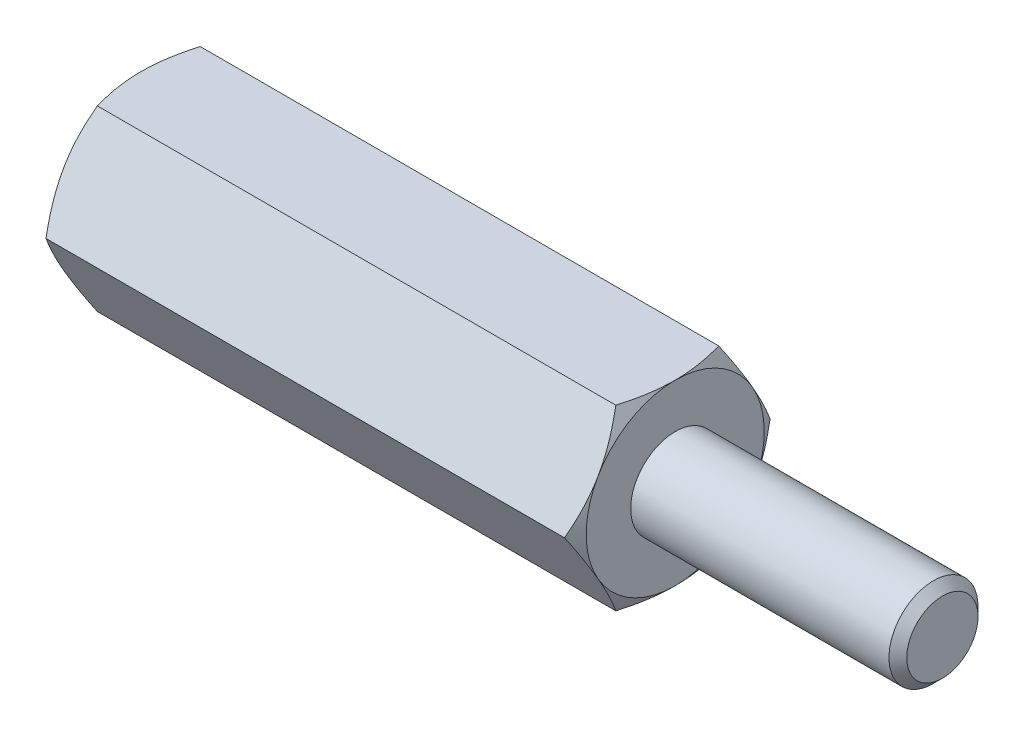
ISO-10303-21;
HEADER;
FILE_DESCRIPTION(('STEP AP214'),'2;1');
FILE_NAME('part.step','',(''),(''),'','','');
FILE_SCHEMA(('AUTOMOTIVE_DESIGN { 1 0 10303 214 1 1 1 1 }'));
ENDSEC;
DATA;
#1=APPLICATION_CONTEXT('core data for automotive mechanical design processes');
#2=APPLICATION_PROTOCOL_DEFINITION('international standard','automotive_design',2000,#1);
#3=PRODUCT_CONTEXT('',#1,'mechanical');
#4=PRODUCT('Part','Part','',(#3));
#5=PRODUCT_RELATED_PRODUCT_CATEGORY('part','',(#4));
#6=PRODUCT_DEFINITION_FORMATION('','',#4);
#7=PRODUCT_DEFINITION_CONTEXT('part definition',#1,'design');
#8=PRODUCT_DEFINITION('design','',#6,#7);
#9=PRODUCT_DEFINITION_SHAPE('','',#8);
#10=(LENGTH_UNIT() NAMED_UNIT(*) SI_UNIT(.MILLI.,.METRE.));
#11=(NAMED_UNIT(*) PLANE_ANGLE_UNIT() SI_UNIT($,.RADIAN.));
#12=(NAMED_UNIT(*) SI_UNIT($,.STERADIAN.) SOLID_ANGLE_UNIT());
#13=UNCERTAINTY_MEASURE_WITH_UNIT(LENGTH_MEASURE(1.E-05),#10,'distance_accuracy_value','');
#14=(GEOMETRIC_REPRESENTATION_CONTEXT(3) GLOBAL_UNCERTAINTY_ASSIGNED_CONTEXT((#13)) GLOBAL_UNIT_ASSIGNED_CONTEXT((#10,
#11,#12)) REPRESENTATION_CONTEXT('',''));
#15=CARTESIAN_POINT('',(0.,0.,0.));
#16=DIRECTION('',(0.,0.,1.));
#17=DIRECTION('',(1.,0.,0.));
#18=AXIS2_PLACEMENT_3D('',#15,#16,#17);
#19=CARTESIAN_POINT('',(6.,2.,-1.15470053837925));
#20=DIRECTION('',(1.,0.,0.));
#21=DIRECTION('',(0.,0.,-1.));
#22=AXIS2_PLACEMENT_3D('',#19,#20,#21);
#23=PLANE('',#22);
#24=CARTESIAN_POINT('',(6.,0.,0.));
#25=DIRECTION('',(1.,0.,0.));
#26=DIRECTION('',(0.,0.,-1.));
#27=AXIS2_PLACEMENT_3D('',#24,#25,#26);
#28=CIRCLE('',#27,2.);
#29=CARTESIAN_POINT('',(6.,-1.,-1.73205080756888));
#30=VERTEX_POINT('',#29);
#31=CARTESIAN_POINT('',(6.,0.999999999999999,-1.73205080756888));
#32=VERTEX_POINT('',#31);
#33=EDGE_CURVE('E288',#30,#32,#28,.T.);
#34=ORIENTED_EDGE('',*,*,#33,.T.);
#35=CARTESIAN_POINT('',(6.,2.,0.));
#36=VERTEX_POINT('',#35);
#37=EDGE_CURVE('E53',#32,#36,#28,.T.);
#38=ORIENTED_EDGE('',*,*,#37,.T.);
#39=CARTESIAN_POINT('',(6.,1.,1.73205080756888));
#40=VERTEX_POINT('',#39);
#41=EDGE_CURVE('E297',#36,#40,#28,.T.);
#42=ORIENTED_EDGE('',*,*,#41,.T.);
#43=CARTESIAN_POINT('',(6.,-1.,1.73205080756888));
#44=VERTEX_POINT('',#43);
#45=EDGE_CURVE('E301',#40,#44,#28,.T.);
#46=ORIENTED_EDGE('',*,*,#45,.T.);
#47=CARTESIAN_POINT('',(6.,0.,0.));
#48=DIRECTION('',(-1.,0.,0.));
#49=DIRECTION('',(0.,-1.,0.));
#50=AXIS2_PLACEMENT_3D('',#47,#48,#49);
#51=CIRCLE('',#50,2.);
#52=CARTESIAN_POINT('',(6.,-2.,0.));
#53=VERTEX_POINT('',#52);
#54=EDGE_CURVE('E193',#53,#44,#51,.T.);
#55=ORIENTED_EDGE('',*,*,#54,.F.);
#56=EDGE_CURVE('E61',#53,#30,#28,.T.);
#57=ORIENTED_EDGE('',*,*,#56,.T.);
#58=EDGE_LOOP('',(#34,#38,#42,#46,#55,#57));
#59=FACE_BOUND('',#58,.T.);
#60=CARTESIAN_POINT('',(6.,0.,0.));
#61=DIRECTION('',(1.,0.,0.));
#62=DIRECTION('',(0.,0.,-1.));
#63=AXIS2_PLACEMENT_3D('',#60,#61,#62);
#64=CIRCLE('',#63,1.);
#65=CARTESIAN_POINT('',(6.,0.,-1.));
#66=VERTEX_POINT('',#65);
#67=EDGE_CURVE('E399',#66,#66,#64,.T.);
#68=ORIENTED_EDGE('',*,*,#67,.F.);
#69=EDGE_LOOP('',(#68));
#70=FACE_BOUND('',#69,.T.);
#71=ADVANCED_FACE('F37',(#59,#70),#23,.T.);
#72=CARTESIAN_POINT('',(6.,0.,-2.3094010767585));
#73=DIRECTION('',(0.,-0.5,0.866025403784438));
#74=DIRECTION('',(0.,-0.866025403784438,-0.5));
#75=AXIS2_PLACEMENT_3D('',#72,#73,#74);
#76=PLANE('',#75);
#77=CARTESIAN_POINT('',(5.8213005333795,-0.000200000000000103,-2.30951654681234));
#78=CARTESIAN_POINT('',(5.85061046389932,0.08769126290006,-2.25877250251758));
#79=CARTESIAN_POINT('',(5.87726714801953,0.176341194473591,-2.20759044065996));
#80=CARTESIAN_POINT('',(5.92379750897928,0.355176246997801,-2.10433997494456));
#81=CARTESIAN_POINT('',(5.94365472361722,0.445364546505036,-2.05226973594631));
#82=CARTESIAN_POINT('',(5.97456653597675,0.624623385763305,-1.94877459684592));
#83=CARTESIAN_POINT('',(5.98582684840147,0.713666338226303,-1.89736562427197));
#84=CARTESIAN_POINT('',(5.99927133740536,0.892171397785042,-1.79430568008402));
#85=CARTESIAN_POINT('',(6.00146664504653,0.981632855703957,-1.74265508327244));
#86=CARTESIAN_POINT('',(5.99690901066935,1.1488083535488,-1.64613626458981));
#87=CARTESIAN_POINT('',(5.99127512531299,1.22654737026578,-1.60125362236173));
#88=CARTESIAN_POINT('',(5.97341610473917,1.38151891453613,-1.51178075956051));
#89=CARTESIAN_POINT('',(5.96118486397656,1.4587509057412,-1.46719084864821));
#90=CARTESIAN_POINT('',(5.93060656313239,1.6140421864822,-1.37753338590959));
#91=CARTESIAN_POINT('',(5.91212983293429,1.69208181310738,-1.33247718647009));
#92=CARTESIAN_POINT('',(5.87019448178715,1.84699686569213,-1.24303693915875));
#93=CARTESIAN_POINT('',(5.84674571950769,1.92387427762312,-1.1986517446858));
#94=CARTESIAN_POINT('',(5.8213005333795,2.0002,-1.15458506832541));
#95=B_SPLINE_CURVE_WITH_KNOTS('',3,(#77,#78,#79,#80,#81,#82,#83,#84,#85,#86,#87,#88,#89,#90,#91,
#92,#93,#94),.UNSPECIFIED.,.F.,.F.,(4,2,2,2,2,2,2,2,4),(0.,0.31703182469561,0.634825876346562,
0.944753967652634,1.25430138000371,1.52387047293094,1.79368946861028,2.06949491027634,
2.34475850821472),.UNSPECIFIED.);
#96=CARTESIAN_POINT('',(5.82136720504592,0.,-2.3094010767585));
#97=VERTEX_POINT('',#96);
#98=EDGE_CURVE('E361',#97,#32,#95,.T.);
#99=ORIENTED_EDGE('',*,*,#98,.F.);
#100=DIRECTION('',(-1.,0.,0.));
#101=VECTOR('',#100,1.);
#102=CARTESIAN_POINT('',(6.,0.,-2.3094010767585));
#103=LINE('',#102,#101);
#104=CARTESIAN_POINT('',(-5.82136720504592,0.,-2.3094010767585));
#105=VERTEX_POINT('',#104);
#106=EDGE_CURVE('E264',#97,#105,#103,.T.);
#107=ORIENTED_EDGE('',*,*,#106,.T.);
#108=CARTESIAN_POINT('',(-5.8213005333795,2.0002,-1.15458506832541));
#109=CARTESIAN_POINT('',(-5.85061046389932,1.91230873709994,-1.20532911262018));
#110=CARTESIAN_POINT('',(-5.87726714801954,1.82365880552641,-1.2565111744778));
#111=CARTESIAN_POINT('',(-5.92379750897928,1.6448237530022,-1.35976164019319));
#112=CARTESIAN_POINT('',(-5.94365472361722,1.55463545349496,-1.41183187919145));
#113=CARTESIAN_POINT('',(-5.97456653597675,1.37537661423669,-1.51532701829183));
#114=CARTESIAN_POINT('',(-5.98582684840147,1.2863336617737,-1.56673599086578));
#115=CARTESIAN_POINT('',(-5.99927133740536,1.10782860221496,-1.66979593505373));
#116=CARTESIAN_POINT('',(-6.00146664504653,1.01836714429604,-1.72144653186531));
#117=CARTESIAN_POINT('',(-5.99690901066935,0.851191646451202,-1.81796535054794));
#118=CARTESIAN_POINT('',(-5.99127512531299,0.773452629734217,-1.86284799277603));
#119=CARTESIAN_POINT('',(-5.97341610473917,0.618481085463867,-1.95232085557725));
#120=CARTESIAN_POINT('',(-5.96118486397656,0.541249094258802,-1.99691076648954));
#121=CARTESIAN_POINT('',(-5.93060656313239,0.385957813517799,-2.08656822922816));
#122=CARTESIAN_POINT('',(-5.91212983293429,0.307918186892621,-2.13162442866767));
#123=CARTESIAN_POINT('',(-5.87019448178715,0.153003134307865,-2.221064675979));
#124=CARTESIAN_POINT('',(-5.84674571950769,0.0761257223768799,-2.26544987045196));
#125=CARTESIAN_POINT('',(-5.8213005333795,-0.000200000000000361,-2.30951654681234));
#126=B_SPLINE_CURVE_WITH_KNOTS('',3,(#108,#109,#110,#111,#112,#113,#114,#115,#116,#117,#118,
#119,#120,#121,#122,#123,#124,#125),.UNSPECIFIED.,.F.,.F.,(4,2,2,2,2,2,2,2,4),(0.,
0.317031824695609,0.634825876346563,0.944753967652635,1.25430138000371,1.52387047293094,
1.79368946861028,2.06949491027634,2.34475850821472),.UNSPECIFIED.);
#127=CARTESIAN_POINT('',(-6.,0.999999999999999,-1.73205080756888));
#128=VERTEX_POINT('',#127);
#129=EDGE_CURVE('E314',#128,#105,#126,.T.);
#130=ORIENTED_EDGE('',*,*,#129,.F.);
#131=CARTESIAN_POINT('',(-5.82136720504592,2.,-1.15470053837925));
#132=VERTEX_POINT('',#131);
#133=EDGE_CURVE('E337',#132,#128,#126,.T.);
#134=ORIENTED_EDGE('',*,*,#133,.F.);
#135=DIRECTION('',(-1.,0.,0.));
#136=VECTOR('',#135,1.);
#137=CARTESIAN_POINT('',(6.,2.,-1.15470053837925));
#138=LINE('',#137,#136);
#139=CARTESIAN_POINT('',(5.821367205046,2.,-1.15470053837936));
#140=VERTEX_POINT('',#139);
#141=EDGE_CURVE('E279',#140,#132,#138,.T.);
#142=ORIENTED_EDGE('',*,*,#141,.F.);
#143=EDGE_CURVE('E229',#32,#140,#95,.T.);
#144=ORIENTED_EDGE('',*,*,#143,.F.);
#145=EDGE_LOOP('',(#99,#107,#130,#134,#142,#144));
#146=FACE_BOUND('',#145,.T.);
#147=ADVANCED_FACE('F148',(#146),#76,.F.);
#148=CARTESIAN_POINT('',(6.,2.,-1.15470053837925));
#149=DIRECTION('',(0.,-1.,0.));
#150=DIRECTION('',(0.,0.,-1.));
#151=AXIS2_PLACEMENT_3D('',#148,#149,#150);
#152=PLANE('',#151);
#153=CARTESIAN_POINT('',(5.0041453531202,2.,-3.14239762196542));
#154=CARTESIAN_POINT('',(5.04685680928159,2.,-3.05468337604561));
#155=CARTESIAN_POINT('',(5.08917030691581,2.,-2.96677207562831));
#156=CARTESIAN_POINT('',(5.17277831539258,2.,-2.79045070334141));
#157=CARTESIAN_POINT('',(5.21407267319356,2.,-2.70204055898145));
#158=CARTESIAN_POINT('',(5.29561838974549,2.,-2.52418069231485));
#159=CARTESIAN_POINT('',(5.33586319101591,2.,-2.43472795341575));
#160=CARTESIAN_POINT('',(5.41475904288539,2.,-2.25512498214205));
#161=CARTESIAN_POINT('',(5.45341016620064,2.,-2.16497478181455));
#162=CARTESIAN_POINT('',(5.52996617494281,2.,-1.98078525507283));
#163=CARTESIAN_POINT('',(5.56780217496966,2.,-1.88671714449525));
#164=CARTESIAN_POINT('',(5.64070044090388,2.,-1.69751412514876));
#165=CARTESIAN_POINT('',(5.67576294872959,2.,-1.60237931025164));
#166=CARTESIAN_POINT('',(5.74223535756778,2.,-1.41102905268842));
#167=CARTESIAN_POINT('',(5.77365196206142,2.,-1.31481596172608));
#168=CARTESIAN_POINT('',(5.83184764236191,2.,-1.12101028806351));
#169=CARTESIAN_POINT('',(5.8586281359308,2.,-1.02341813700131));
#170=CARTESIAN_POINT('',(5.90615162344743,2.,-0.827336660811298));
#171=CARTESIAN_POINT('',(5.9269281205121,2.,-0.728855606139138));
#172=CARTESIAN_POINT('',(5.96129559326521,2.,-0.530628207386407));
#173=CARTESIAN_POINT('',(5.97488733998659,2.,-0.430882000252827));
#174=CARTESIAN_POINT('',(5.99362159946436,2.,-0.231937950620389));
#175=CARTESIAN_POINT('',(5.99887592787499,2.,-0.132750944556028));
#176=CARTESIAN_POINT('',(6.00079968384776,2.,0.0657049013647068));
#177=CARTESIAN_POINT('',(5.9974689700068,2.,0.164973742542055));
#178=CARTESIAN_POINT('',(5.97965125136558,2.,0.400692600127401));
#179=CARTESIAN_POINT('',(5.96138848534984,2.,0.53685971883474));
#180=CARTESIAN_POINT('',(5.91179958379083,2.,0.806792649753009));
#181=CARTESIAN_POINT('',(5.88046153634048,2.,0.940556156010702));
#182=CARTESIAN_POINT('',(5.80733694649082,2.,1.20849227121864));
#183=CARTESIAN_POINT('',(5.76532316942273,2.,1.34260127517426));
#184=CARTESIAN_POINT('',(5.69701155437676,2.,1.54188460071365));
#185=CARTESIAN_POINT('',(5.67336125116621,2.,1.6079939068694));
#186=CARTESIAN_POINT('',(5.62457310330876,2.,1.73966131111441));
#187=CARTESIAN_POINT('',(5.59943529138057,2.,1.80521942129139));
#188=CARTESIAN_POINT('',(5.53045244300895,2.,1.98014362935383));
#189=CARTESIAN_POINT('',(5.48548288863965,2.,2.08906517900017));
#190=CARTESIAN_POINT('',(5.39293953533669,2.,2.3058004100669));
#191=CARTESIAN_POINT('',(5.34536546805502,2.,2.41361397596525));
#192=CARTESIAN_POINT('',(5.24822629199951,2.,2.62838132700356));
#193=CARTESIAN_POINT('',(5.19866051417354,2.,2.7353348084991));
#194=CARTESIAN_POINT('',(5.09800140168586,2.,2.94852186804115));
#195=CARTESIAN_POINT('',(5.04690802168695,2.,3.05475542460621));
#196=CARTESIAN_POINT('',(4.89169615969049,2.,3.37291303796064));
#197=CARTESIAN_POINT('',(4.78579652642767,2.,3.58396705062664));
#198=CARTESIAN_POINT('',(4.57100981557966,2.,4.00448363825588));
#199=CARTESIAN_POINT('',(4.46212334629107,2.,4.21394652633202));
#200=CARTESIAN_POINT('',(4.25376773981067,2.,4.61000648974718));
#201=CARTESIAN_POINT('',(4.15450073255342,2.,4.79671008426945));
#202=CARTESIAN_POINT('',(3.95476413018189,2.,5.16948614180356));
#203=CARTESIAN_POINT('',(3.85429446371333,2.,5.35555856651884));
#204=CARTESIAN_POINT('',(3.6527937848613,2.,5.72660635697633));
#205=CARTESIAN_POINT('',(3.55176570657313,2.,5.91158331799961));
#206=CARTESIAN_POINT('',(3.34902395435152,2.,6.28114276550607));
#207=CARTESIAN_POINT('',(3.24731033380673,2.,6.46572528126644));
#208=CARTESIAN_POINT('',(3.14534707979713,2.,6.65016883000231));
#209=B_SPLINE_CURVE_WITH_KNOTS('',3,(#153,#154,#155,#156,#157,#158,#159,#160,#161,#162,#163,
#164,#165,#166,#167,#168,#169,#170,#171,#172,#173,#174,#175,#176,#177,#178,#179,#180,#181,#182,
#183,#184,#185,#186,#187,#188,#189,#190,#191,#192,#193,#194,#195,#196,#197,#198,#199,#200,#201,
#202,#203,#204,#205,#206,#207,#208),.UNSPECIFIED.,.F.,.F.,(4,2,2,2,2,2,2,2,2,2,2,2,2,2,2,2,2,2,
2,2,2,2,2,2,2,2,2,4),(0.,0.292684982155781,0.585413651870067,0.879667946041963,1.17390879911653,
1.47805164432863,1.78216793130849,2.08571589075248,2.38917085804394,2.690898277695,
2.99259331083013,3.29020694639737,3.58782548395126,3.99913738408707,4.41082482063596,
4.8321411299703,5.0427662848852,5.25338680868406,5.6068563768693,5.96036243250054,
6.31398824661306,6.66762456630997,7.37597688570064,8.08418599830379,8.71853756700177,
9.35292696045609,9.98522933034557,10.6174830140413),.UNSPECIFIED.);
#210=EDGE_CURVE('E227',#140,#36,#209,.T.);
#211=ORIENTED_EDGE('',*,*,#210,.F.);
#212=ORIENTED_EDGE('',*,*,#141,.T.);
#213=CARTESIAN_POINT('',(-5.0041453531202,2.,-3.14239762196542));
#214=CARTESIAN_POINT('',(-5.04685680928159,2.,-3.05468337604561));
#215=CARTESIAN_POINT('',(-5.08917030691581,2.,-2.96677207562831));
#216=CARTESIAN_POINT('',(-5.17277831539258,2.,-2.79045070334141));
#217=CARTESIAN_POINT('',(-5.21407267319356,2.,-2.70204055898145));
#218=CARTESIAN_POINT('',(-5.29561838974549,2.,-2.52418069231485));
#219=CARTESIAN_POINT('',(-5.33586319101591,2.,-2.43472795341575));
#220=CARTESIAN_POINT('',(-5.41475904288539,2.,-2.25512498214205));
#221=CARTESIAN_POINT('',(-5.45341016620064,2.,-2.16497478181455));
#222=CARTESIAN_POINT('',(-5.52996617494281,2.,-1.98078525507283));
#223=CARTESIAN_POINT('',(-5.56780217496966,2.,-1.88671714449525));
#224=CARTESIAN_POINT('',(-5.64070044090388,2.,-1.69751412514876));
#225=CARTESIAN_POINT('',(-5.67576294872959,2.,-1.60237931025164));
#226=CARTESIAN_POINT('',(-5.74223535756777,2.,-1.41102905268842));
#227=CARTESIAN_POINT('',(-5.77365196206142,2.,-1.31481596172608));
#228=CARTESIAN_POINT('',(-5.83184764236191,2.,-1.12101028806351));
#229=CARTESIAN_POINT('',(-5.8586281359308,2.,-1.02341813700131));
#230=CARTESIAN_POINT('',(-5.90615162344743,2.,-0.827336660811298));
#231=CARTESIAN_POINT('',(-5.9269281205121,2.,-0.728855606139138));
#232=CARTESIAN_POINT('',(-5.96129559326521,2.,-0.530628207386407));
#233=CARTESIAN_POINT('',(-5.97488733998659,2.,-0.430882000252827));
#234=CARTESIAN_POINT('',(-5.99362159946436,2.,-0.231937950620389));
#235=CARTESIAN_POINT('',(-5.99887592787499,2.,-0.132750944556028));
#236=CARTESIAN_POINT('',(-6.00079968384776,2.,0.0657049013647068));
#237=CARTESIAN_POINT('',(-5.9974689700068,2.,0.164973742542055));
#238=CARTESIAN_POINT('',(-5.97965125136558,2.,0.400692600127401));
#239=CARTESIAN_POINT('',(-5.96138848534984,2.,0.53685971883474));
#240=CARTESIAN_POINT('',(-5.91179958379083,2.,0.806792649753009));
#241=CARTESIAN_POINT('',(-5.88046153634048,2.,0.940556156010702));
#242=CARTESIAN_POINT('',(-5.80733694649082,2.,1.20849227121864));
#243=CARTESIAN_POINT('',(-5.76532316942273,2.,1.34260127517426));
#244=CARTESIAN_POINT('',(-5.69701155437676,2.,1.54188460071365));
#245=CARTESIAN_POINT('',(-5.67336125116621,2.,1.6079939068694));
#246=CARTESIAN_POINT('',(-5.62457310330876,2.,1.73966131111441));
#247=CARTESIAN_POINT('',(-5.59943529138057,2.,1.80521942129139));
#248=CARTESIAN_POINT('',(-5.53045244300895,2.,1.98014362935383));
#249=CARTESIAN_POINT('',(-5.48548288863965,2.,2.08906517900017));
#250=CARTESIAN_POINT('',(-5.39293953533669,2.,2.3058004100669));
#251=CARTESIAN_POINT('',(-5.34536546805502,2.,2.41361397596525));
#252=CARTESIAN_POINT('',(-5.24822629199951,2.,2.62838132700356));
#253=CARTESIAN_POINT('',(-5.19866051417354,2.,2.7353348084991));
#254=CARTESIAN_POINT('',(-5.09800140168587,2.,2.94852186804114));
#255=CARTESIAN_POINT('',(-5.04690802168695,2.,3.05475542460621));
#256=CARTESIAN_POINT('',(-4.89169615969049,2.,3.37291303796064));
#257=CARTESIAN_POINT('',(-4.78579652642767,2.,3.58396705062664));
#258=CARTESIAN_POINT('',(-4.57100981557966,2.,4.00448363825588));
#259=CARTESIAN_POINT('',(-4.46212334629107,2.,4.21394652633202));
#260=CARTESIAN_POINT('',(-4.25376773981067,2.,4.61000648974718));
#261=CARTESIAN_POINT('',(-4.15450073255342,2.,4.79671008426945));
#262=CARTESIAN_POINT('',(-3.95476413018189,2.,5.16948614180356));
#263=CARTESIAN_POINT('',(-3.85429446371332,2.,5.35555856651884));
#264=CARTESIAN_POINT('',(-3.6527937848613,2.,5.72660635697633));
#265=CARTESIAN_POINT('',(-3.55176570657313,2.,5.91158331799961));
#266=CARTESIAN_POINT('',(-3.34902395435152,2.,6.28114276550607));
#267=CARTESIAN_POINT('',(-3.24731033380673,2.,6.46572528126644));
#268=CARTESIAN_POINT('',(-3.14534707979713,2.,6.65016883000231));
#269=B_SPLINE_CURVE_WITH_KNOTS('',3,(#213,#214,#215,#216,#217,#218,#219,#220,#221,#222,#223,
#224,#225,#226,#227,#228,#229,#230,#231,#232,#233,#234,#235,#236,#237,#238,#239,#240,#241,#242,
#243,#244,#245,#246,#247,#248,#249,#250,#251,#252,#253,#254,#255,#256,#257,#258,#259,#260,#261,
#262,#263,#264,#265,#266,#267,#268),.UNSPECIFIED.,.F.,.F.,(4,2,2,2,2,2,2,2,2,2,2,2,2,2,2,2,2,2,
2,2,2,2,2,2,2,2,2,4),(0.,0.292684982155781,0.585413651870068,0.879667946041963,1.17390879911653,
1.47805164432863,1.78216793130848,2.08571589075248,2.38917085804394,2.690898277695,
2.99259331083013,3.29020694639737,3.58782548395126,3.99913738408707,4.41082482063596,
4.8321411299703,5.0427662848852,5.25338680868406,5.6068563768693,5.96036243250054,
6.31398824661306,6.66762456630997,7.37597688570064,8.08418599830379,8.71853756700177,
9.3529269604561,9.98522933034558,10.6174830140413),.UNSPECIFIED.);
#270=CARTESIAN_POINT('',(-6.,2.,0.));
#271=VERTEX_POINT('',#270);
#272=EDGE_CURVE('E241',#271,#132,#269,.F.);
#273=ORIENTED_EDGE('',*,*,#272,.F.);
#274=CARTESIAN_POINT('',(-5.82136720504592,2.,1.15470053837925));
#275=VERTEX_POINT('',#274);
#276=EDGE_CURVE('E249',#275,#271,#269,.F.);
#277=ORIENTED_EDGE('',*,*,#276,.F.);
#278=DIRECTION('',(-1.,0.,0.));
#279=VECTOR('',#278,1.);
#280=CARTESIAN_POINT('',(6.,2.,1.15470053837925));
#281=LINE('',#280,#279);
#282=CARTESIAN_POINT('',(5.82136720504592,2.,1.15470053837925));
#283=VERTEX_POINT('',#282);
#284=EDGE_CURVE('E276',#283,#275,#281,.T.);
#285=ORIENTED_EDGE('',*,*,#284,.F.);
#286=EDGE_CURVE('E221',#36,#283,#209,.T.);
#287=ORIENTED_EDGE('',*,*,#286,.F.);
#288=EDGE_LOOP('',(#211,#212,#273,#277,#285,#287));
#289=FACE_BOUND('',#288,.T.);
#290=ADVANCED_FACE('F153',(#289),#152,.F.);
#291=CARTESIAN_POINT('',(6.,2.,1.15470053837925));
#292=DIRECTION('',(0.,-0.5,-0.866025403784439));
#293=DIRECTION('',(0.,0.866025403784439,-0.5));
#294=AXIS2_PLACEMENT_3D('',#291,#292,#293);
#295=PLANE('',#294);
#296=CARTESIAN_POINT('',(5.8213005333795,2.0002,1.15458506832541));
#297=CARTESIAN_POINT('',(5.85061046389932,1.91230873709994,1.20532911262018));
#298=CARTESIAN_POINT('',(5.87726714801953,1.82365880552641,1.2565111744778));
#299=CARTESIAN_POINT('',(5.92379750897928,1.6448237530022,1.35976164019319));
#300=CARTESIAN_POINT('',(5.94365472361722,1.55463545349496,1.41183187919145));
#301=CARTESIAN_POINT('',(5.97456653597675,1.37537661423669,1.51532701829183));
#302=CARTESIAN_POINT('',(5.98582684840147,1.2863336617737,1.56673599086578));
#303=CARTESIAN_POINT('',(5.99927133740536,1.10782860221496,1.66979593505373));
#304=CARTESIAN_POINT('',(6.00146664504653,1.01836714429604,1.72144653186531));
#305=CARTESIAN_POINT('',(5.99690901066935,0.851191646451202,1.81796535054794));
#306=CARTESIAN_POINT('',(5.99127512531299,0.773452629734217,1.86284799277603));
#307=CARTESIAN_POINT('',(5.97341610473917,0.618481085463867,1.95232085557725));
#308=CARTESIAN_POINT('',(5.96118486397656,0.541249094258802,1.99691076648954));
#309=CARTESIAN_POINT('',(5.93060656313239,0.3859578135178,2.08656822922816));
#310=CARTESIAN_POINT('',(5.91212983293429,0.307918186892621,2.13162442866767));
#311=CARTESIAN_POINT('',(5.87019448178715,0.153003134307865,2.221064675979));
#312=CARTESIAN_POINT('',(5.84674571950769,0.0761257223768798,2.26544987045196));
#313=CARTESIAN_POINT('',(5.8213005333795,-0.000199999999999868,2.30951654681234));
#314=B_SPLINE_CURVE_WITH_KNOTS('',3,(#296,#297,#298,#299,#300,#301,#302,#303,#304,#305,#306,
#307,#308,#309,#310,#311,#312,#313),.UNSPECIFIED.,.F.,.F.,(4,2,2,2,2,2,2,2,4),(0.,
0.31703182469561,0.634825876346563,0.944753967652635,1.25430138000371,1.52387047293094,
1.79368946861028,2.06949491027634,2.34475850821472),.UNSPECIFIED.);
#315=EDGE_CURVE('E228',#283,#40,#314,.T.);
#316=ORIENTED_EDGE('',*,*,#315,.F.);
#317=ORIENTED_EDGE('',*,*,#284,.T.);
#318=CARTESIAN_POINT('',(-5.8213005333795,-0.000199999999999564,2.30951654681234));
#319=CARTESIAN_POINT('',(-5.85061046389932,0.0876912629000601,2.25877250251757));
#320=CARTESIAN_POINT('',(-5.87726714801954,0.176341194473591,2.20759044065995));
#321=CARTESIAN_POINT('',(-5.92379750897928,0.355176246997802,2.10433997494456));
#322=CARTESIAN_POINT('',(-5.94365472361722,0.445364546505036,2.0522697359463));
#323=CARTESIAN_POINT('',(-5.97456653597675,0.624623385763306,1.94877459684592));
#324=CARTESIAN_POINT('',(-5.98582684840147,0.713666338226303,1.89736562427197));
#325=CARTESIAN_POINT('',(-5.99927133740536,0.892171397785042,1.79430568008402));
#326=CARTESIAN_POINT('',(-6.00146664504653,0.981632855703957,1.74265508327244));
#327=CARTESIAN_POINT('',(-5.99690901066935,1.1488083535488,1.64613626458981));
#328=CARTESIAN_POINT('',(-5.99127512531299,1.22654737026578,1.60125362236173));
#329=CARTESIAN_POINT('',(-5.97341610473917,1.38151891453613,1.51178075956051));
#330=CARTESIAN_POINT('',(-5.96118486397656,1.4587509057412,1.46719084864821));
#331=CARTESIAN_POINT('',(-5.93060656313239,1.6140421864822,1.37753338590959));
#332=CARTESIAN_POINT('',(-5.91212983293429,1.69208181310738,1.33247718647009));
#333=CARTESIAN_POINT('',(-5.87019448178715,1.84699686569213,1.24303693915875));
#334=CARTESIAN_POINT('',(-5.84674571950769,1.92387427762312,1.1986517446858));
#335=CARTESIAN_POINT('',(-5.8213005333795,2.0002,1.15458506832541));
#336=B_SPLINE_CURVE_WITH_KNOTS('',3,(#318,#319,#320,#321,#322,#323,#324,#325,#326,#327,#328,
#329,#330,#331,#332,#333,#334,#335),.UNSPECIFIED.,.F.,.F.,(4,2,2,2,2,2,2,2,4),(0.,
0.317031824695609,0.634825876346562,0.944753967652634,1.25430138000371,1.52387047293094,
1.79368946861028,2.06949491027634,2.34475850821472),.UNSPECIFIED.);
#337=CARTESIAN_POINT('',(-6.,1.,1.73205080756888));
#338=VERTEX_POINT('',#337);
#339=EDGE_CURVE('E255',#338,#275,#336,.T.);
#340=ORIENTED_EDGE('',*,*,#339,.F.);
#341=CARTESIAN_POINT('',(-5.82136720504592,0.,2.3094010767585));
#342=VERTEX_POINT('',#341);
#343=EDGE_CURVE('E262',#342,#338,#336,.T.);
#344=ORIENTED_EDGE('',*,*,#343,.F.);
#345=DIRECTION('',(-1.,0.,0.));
#346=VECTOR('',#345,1.);
#347=CARTESIAN_POINT('',(6.,0.,2.3094010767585));
#348=LINE('',#347,#346);
#349=CARTESIAN_POINT('',(5.82136720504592,0.,2.3094010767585));
#350=VERTEX_POINT('',#349);
#351=EDGE_CURVE('E273',#350,#342,#348,.T.);
#352=ORIENTED_EDGE('',*,*,#351,.F.);
#353=EDGE_CURVE('E215',#40,#350,#314,.T.);
#354=ORIENTED_EDGE('',*,*,#353,.F.);
#355=EDGE_LOOP('',(#316,#317,#340,#344,#352,#354));
#356=FACE_BOUND('',#355,.T.);
#357=ADVANCED_FACE('F235',(#356),#295,.F.);
#358=CARTESIAN_POINT('',(6.,0.,2.3094010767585));
#359=DIRECTION('',(0.,0.5,-0.866025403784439));
#360=DIRECTION('',(0.,0.866025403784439,0.5));
#361=AXIS2_PLACEMENT_3D('',#358,#359,#360);
#362=PLANE('',#361);
#363=CARTESIAN_POINT('',(5.8213005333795,0.000200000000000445,2.30951654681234));
#364=CARTESIAN_POINT('',(5.85061046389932,-0.0876912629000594,2.25877250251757));
#365=CARTESIAN_POINT('',(5.87726714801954,-0.176341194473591,2.20759044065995));
#366=CARTESIAN_POINT('',(5.92379750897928,-0.355176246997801,2.10433997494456));
#367=CARTESIAN_POINT('',(5.94365472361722,-0.445364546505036,2.0522697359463));
#368=CARTESIAN_POINT('',(5.97456653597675,-0.624623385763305,1.94877459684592));
#369=CARTESIAN_POINT('',(5.98582684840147,-0.713666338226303,1.89736562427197));
#370=CARTESIAN_POINT('',(5.99927133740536,-0.892171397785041,1.79430568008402));
#371=CARTESIAN_POINT('',(6.00146664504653,-0.981632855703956,1.74265508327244));
#372=CARTESIAN_POINT('',(5.99690901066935,-1.1488083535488,1.64613626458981));
#373=CARTESIAN_POINT('',(5.99127512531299,-1.22654737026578,1.60125362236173));
#374=CARTESIAN_POINT('',(5.97341610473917,-1.38151891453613,1.51178075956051));
#375=CARTESIAN_POINT('',(5.96118486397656,-1.4587509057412,1.46719084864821));
#376=CARTESIAN_POINT('',(5.93060656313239,-1.6140421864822,1.37753338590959));
#377=CARTESIAN_POINT('',(5.91212983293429,-1.69208181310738,1.33247718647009));
#378=CARTESIAN_POINT('',(5.87019448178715,-1.84699686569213,1.24303693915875));
#379=CARTESIAN_POINT('',(5.84674571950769,-1.92387427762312,1.1986517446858));
#380=CARTESIAN_POINT('',(5.8213005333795,-2.0002,1.15458506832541));
#381=B_SPLINE_CURVE_WITH_KNOTS('',3,(#363,#364,#365,#366,#367,#368,#369,#370,#371,#372,#373,
#374,#375,#376,#377,#378,#379,#380),.UNSPECIFIED.,.F.,.F.,(4,2,2,2,2,2,2,2,4),(0.,
0.31703182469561,0.634825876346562,0.944753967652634,1.25430138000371,1.52387047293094,
1.79368946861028,2.06949491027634,2.34475850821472),.UNSPECIFIED.);
#382=EDGE_CURVE('E317',#350,#44,#381,.T.);
#383=ORIENTED_EDGE('',*,*,#382,.F.);
#384=ORIENTED_EDGE('',*,*,#351,.T.);
#385=CARTESIAN_POINT('',(-5.8213005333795,-2.0002,1.15458506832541));
#386=CARTESIAN_POINT('',(-5.85061046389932,-1.91230873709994,1.20532911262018));
#387=CARTESIAN_POINT('',(-5.87726714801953,-1.82365880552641,1.2565111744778));
#388=CARTESIAN_POINT('',(-5.92379750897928,-1.6448237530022,1.35976164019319));
#389=CARTESIAN_POINT('',(-5.94365472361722,-1.55463545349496,1.41183187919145));
#390=CARTESIAN_POINT('',(-5.97456653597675,-1.3753766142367,1.51532701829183));
#391=CARTESIAN_POINT('',(-5.98582684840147,-1.2863336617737,1.56673599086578));
#392=CARTESIAN_POINT('',(-5.99927133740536,-1.10782860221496,1.66979593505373));
#393=CARTESIAN_POINT('',(-6.00146664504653,-1.01836714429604,1.72144653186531));
#394=CARTESIAN_POINT('',(-5.99690901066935,-0.851191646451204,1.81796535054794));
#395=CARTESIAN_POINT('',(-5.99127512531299,-0.773452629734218,1.86284799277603));
#396=CARTESIAN_POINT('',(-5.97341610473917,-0.618481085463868,1.95232085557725));
#397=CARTESIAN_POINT('',(-5.96118486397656,-0.541249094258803,1.99691076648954));
#398=CARTESIAN_POINT('',(-5.93060656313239,-0.3859578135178,2.08656822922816));
#399=CARTESIAN_POINT('',(-5.91212983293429,-0.307918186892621,2.13162442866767));
#400=CARTESIAN_POINT('',(-5.87019448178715,-0.153003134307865,2.221064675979));
#401=CARTESIAN_POINT('',(-5.84674571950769,-0.0761257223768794,2.26544987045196));
#402=CARTESIAN_POINT('',(-5.8213005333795,0.000200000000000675,2.30951654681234));
#403=B_SPLINE_CURVE_WITH_KNOTS('',3,(#385,#386,#387,#388,#389,#390,#391,#392,#393,#394,#395,
#396,#397,#398,#399,#400,#401,#402),.UNSPECIFIED.,.F.,.F.,(4,2,2,2,2,2,2,2,4),(0.,
0.317031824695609,0.634825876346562,0.944753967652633,1.25430138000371,1.52387047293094,
1.79368946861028,2.06949491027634,2.34475850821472),.UNSPECIFIED.);
#404=CARTESIAN_POINT('',(-6.,-1.,1.73205080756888));
#405=VERTEX_POINT('',#404);
#406=EDGE_CURVE('E263',#405,#342,#403,.T.);
#407=ORIENTED_EDGE('',*,*,#406,.F.);
#408=CARTESIAN_POINT('',(-5.82136720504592,-2.,1.15470053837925));
#409=VERTEX_POINT('',#408);
#410=EDGE_CURVE('E250',#409,#405,#403,.T.);
#411=ORIENTED_EDGE('',*,*,#410,.F.);
#412=DIRECTION('',(-1.,0.,0.));
#413=VECTOR('',#412,1.);
#414=CARTESIAN_POINT('',(6.,-2.,1.15470053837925));
#415=LINE('',#414,#413);
#416=CARTESIAN_POINT('',(5.82136720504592,-2.,1.15470053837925));
#417=VERTEX_POINT('',#416);
#418=EDGE_CURVE('E270',#417,#409,#415,.T.);
#419=ORIENTED_EDGE('',*,*,#418,.F.);
#420=EDGE_CURVE('E210',#44,#417,#381,.T.);
#421=ORIENTED_EDGE('',*,*,#420,.F.);
#422=EDGE_LOOP('',(#383,#384,#407,#411,#419,#421));
#423=FACE_BOUND('',#422,.T.);
#424=ADVANCED_FACE('F419',(#423),#362,.F.);
#425=CARTESIAN_POINT('',(6.,-2.,1.15470053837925));
#426=DIRECTION('',(0.,1.,0.));
#427=DIRECTION('',(0.,0.,1.));
#428=AXIS2_PLACEMENT_3D('',#425,#426,#427);
#429=PLANE('',#428);
#430=CARTESIAN_POINT('',(5.00414535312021,-2.,-3.14239762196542));
#431=CARTESIAN_POINT('',(5.0468568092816,-2.,-3.05468337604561));
#432=CARTESIAN_POINT('',(5.08917030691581,-2.,-2.96677207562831));
#433=CARTESIAN_POINT('',(5.17277831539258,-2.,-2.79045070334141));
#434=CARTESIAN_POINT('',(5.21407267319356,-2.,-2.70204055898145));
#435=CARTESIAN_POINT('',(5.29561838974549,-2.,-2.52418069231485));
#436=CARTESIAN_POINT('',(5.33586319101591,-2.,-2.43472795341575));
#437=CARTESIAN_POINT('',(5.41475904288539,-2.,-2.25512498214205));
#438=CARTESIAN_POINT('',(5.45341016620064,-2.,-2.16497478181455));
#439=CARTESIAN_POINT('',(5.52996617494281,-2.,-1.98078525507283));
#440=CARTESIAN_POINT('',(5.56780217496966,-2.,-1.88671714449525));
#441=CARTESIAN_POINT('',(5.64070044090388,-2.,-1.69751412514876));
#442=CARTESIAN_POINT('',(5.67576294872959,-2.,-1.60237931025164));
#443=CARTESIAN_POINT('',(5.74223535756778,-2.,-1.41102905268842));
#444=CARTESIAN_POINT('',(5.77365196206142,-2.,-1.31481596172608));
#445=CARTESIAN_POINT('',(5.83184764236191,-2.,-1.12101028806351));
#446=CARTESIAN_POINT('',(5.8586281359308,-2.,-1.02341813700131));
#447=CARTESIAN_POINT('',(5.90615162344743,-2.,-0.827336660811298));
#448=CARTESIAN_POINT('',(5.9269281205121,-2.,-0.728855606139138));
#449=CARTESIAN_POINT('',(5.96129559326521,-2.,-0.530628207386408));
#450=CARTESIAN_POINT('',(5.97488733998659,-2.,-0.430882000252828));
#451=CARTESIAN_POINT('',(5.99362159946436,-2.,-0.23193795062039));
#452=CARTESIAN_POINT('',(5.99887592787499,-2.,-0.132750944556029));
#453=CARTESIAN_POINT('',(6.00079968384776,-2.,0.0657049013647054));
#454=CARTESIAN_POINT('',(5.9974689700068,-2.,0.164973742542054));
#455=CARTESIAN_POINT('',(5.97965125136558,-2.,0.400692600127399));
#456=CARTESIAN_POINT('',(5.96138848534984,-2.,0.536859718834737));
#457=CARTESIAN_POINT('',(5.91179958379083,-2.,0.806792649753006));
#458=CARTESIAN_POINT('',(5.88046153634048,-2.,0.940556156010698));
#459=CARTESIAN_POINT('',(5.80733694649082,-2.,1.20849227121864));
#460=CARTESIAN_POINT('',(5.76532316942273,-2.,1.34260127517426));
#461=CARTESIAN_POINT('',(5.69701155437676,-2.,1.54188460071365));
#462=CARTESIAN_POINT('',(5.67336125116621,-2.,1.60799390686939));
#463=CARTESIAN_POINT('',(5.62457310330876,-2.,1.73966131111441));
#464=CARTESIAN_POINT('',(5.59943529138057,-2.,1.80521942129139));
#465=CARTESIAN_POINT('',(5.53045244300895,-2.,1.98014362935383));
#466=CARTESIAN_POINT('',(5.48548288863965,-2.,2.08906517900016));
#467=CARTESIAN_POINT('',(5.3929395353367,-2.,2.3058004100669));
#468=CARTESIAN_POINT('',(5.34536546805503,-2.,2.41361397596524));
#469=CARTESIAN_POINT('',(5.24822629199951,-2.,2.62838132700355));
#470=CARTESIAN_POINT('',(5.19866051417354,-2.,2.7353348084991));
#471=CARTESIAN_POINT('',(5.09800140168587,-2.,2.94852186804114));
#472=CARTESIAN_POINT('',(5.04690802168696,-2.,3.05475542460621));
#473=CARTESIAN_POINT('',(4.89169615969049,-2.,3.37291303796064));
#474=CARTESIAN_POINT('',(4.78579652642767,-2.,3.58396705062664));
#475=CARTESIAN_POINT('',(4.57100981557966,-2.,4.00448363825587));
#476=CARTESIAN_POINT('',(4.46212334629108,-2.,4.21394652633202));
#477=CARTESIAN_POINT('',(4.25376773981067,-2.,4.61000648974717));
#478=CARTESIAN_POINT('',(4.15450073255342,-2.,4.79671008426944));
#479=CARTESIAN_POINT('',(3.9547641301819,-2.,5.16948614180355));
#480=CARTESIAN_POINT('',(3.85429446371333,-2.,5.35555856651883));
#481=CARTESIAN_POINT('',(3.6527937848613,-2.,5.72660635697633));
#482=CARTESIAN_POINT('',(3.55176570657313,-2.,5.9115833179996));
#483=CARTESIAN_POINT('',(3.34902395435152,-2.,6.28114276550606));
#484=CARTESIAN_POINT('',(3.24731033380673,-2.,6.46572528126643));
#485=CARTESIAN_POINT('',(3.14534707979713,-2.,6.6501688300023));
#486=B_SPLINE_CURVE_WITH_KNOTS('',3,(#430,#431,#432,#433,#434,#435,#436,#437,#438,#439,#440,
#441,#442,#443,#444,#445,#446,#447,#448,#449,#450,#451,#452,#453,#454,#455,#456,#457,#458,#459,
#460,#461,#462,#463,#464,#465,#466,#467,#468,#469,#470,#471,#472,#473,#474,#475,#476,#477,#478,
#479,#480,#481,#482,#483,#484,#485),.UNSPECIFIED.,.F.,.F.,(4,2,2,2,2,2,2,2,2,2,2,2,2,2,2,2,2,2,
2,2,2,2,2,2,2,2,2,4),(0.,0.29268498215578,0.585413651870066,0.879667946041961,1.17390879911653,
1.47805164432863,1.78216793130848,2.08571589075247,2.38917085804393,2.69089827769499,
2.99259331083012,3.29020694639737,3.58782548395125,3.99913738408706,4.41082482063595,
4.83214112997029,5.04276628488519,5.25338680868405,5.60685637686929,5.96036243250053,
6.31398824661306,6.66762456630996,7.37597688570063,8.08418599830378,8.71853756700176,
9.35292696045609,9.98522933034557,10.6174830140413),.UNSPECIFIED.);
#487=EDGE_CURVE('E388',#417,#53,#486,.F.);
#488=ORIENTED_EDGE('',*,*,#487,.F.);
#489=ORIENTED_EDGE('',*,*,#418,.T.);
#490=CARTESIAN_POINT('',(-5.00414535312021,-2.,-3.14239762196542));
#491=CARTESIAN_POINT('',(-5.0468568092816,-2.,-3.05468337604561));
#492=CARTESIAN_POINT('',(-5.08917030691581,-2.,-2.96677207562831));
#493=CARTESIAN_POINT('',(-5.17277831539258,-2.,-2.79045070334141));
#494=CARTESIAN_POINT('',(-5.21407267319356,-2.,-2.70204055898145));
#495=CARTESIAN_POINT('',(-5.29561838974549,-2.,-2.52418069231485));
#496=CARTESIAN_POINT('',(-5.33586319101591,-2.,-2.43472795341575));
#497=CARTESIAN_POINT('',(-5.41475904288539,-2.,-2.25512498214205));
#498=CARTESIAN_POINT('',(-5.45341016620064,-2.,-2.16497478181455));
#499=CARTESIAN_POINT('',(-5.52996617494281,-2.,-1.98078525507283));
#500=CARTESIAN_POINT('',(-5.56780217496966,-2.,-1.88671714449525));
#501=CARTESIAN_POINT('',(-5.64070044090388,-2.,-1.69751412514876));
#502=CARTESIAN_POINT('',(-5.67576294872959,-2.,-1.60237931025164));
#503=CARTESIAN_POINT('',(-5.74223535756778,-2.,-1.41102905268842));
#504=CARTESIAN_POINT('',(-5.77365196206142,-2.,-1.31481596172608));
#505=CARTESIAN_POINT('',(-5.83184764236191,-2.,-1.12101028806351));
#506=CARTESIAN_POINT('',(-5.8586281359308,-2.,-1.02341813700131));
#507=CARTESIAN_POINT('',(-5.90615162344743,-2.,-0.827336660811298));
#508=CARTESIAN_POINT('',(-5.9269281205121,-2.,-0.728855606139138));
#509=CARTESIAN_POINT('',(-5.96129559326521,-2.,-0.530628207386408));
#510=CARTESIAN_POINT('',(-5.97488733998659,-2.,-0.430882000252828));
#511=CARTESIAN_POINT('',(-5.99362159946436,-2.,-0.23193795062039));
#512=CARTESIAN_POINT('',(-5.99887592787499,-2.,-0.132750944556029));
#513=CARTESIAN_POINT('',(-6.00079968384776,-2.,0.0657049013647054));
#514=CARTESIAN_POINT('',(-5.9974689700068,-2.,0.164973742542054));
#515=CARTESIAN_POINT('',(-5.97965125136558,-2.,0.400692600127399));
#516=CARTESIAN_POINT('',(-5.96138848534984,-2.,0.536859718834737));
#517=CARTESIAN_POINT('',(-5.91179958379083,-2.,0.806792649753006));
#518=CARTESIAN_POINT('',(-5.88046153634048,-2.,0.940556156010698));
#519=CARTESIAN_POINT('',(-5.80733694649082,-2.,1.20849227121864));
#520=CARTESIAN_POINT('',(-5.76532316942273,-2.,1.34260127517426));
#521=CARTESIAN_POINT('',(-5.69701155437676,-2.,1.54188460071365));
#522=CARTESIAN_POINT('',(-5.67336125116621,-2.,1.60799390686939));
#523=CARTESIAN_POINT('',(-5.62457310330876,-2.,1.73966131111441));
#524=CARTESIAN_POINT('',(-5.59943529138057,-2.,1.80521942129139));
#525=CARTESIAN_POINT('',(-5.53045244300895,-2.,1.98014362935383));
#526=CARTESIAN_POINT('',(-5.48548288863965,-2.,2.08906517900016));
#527=CARTESIAN_POINT('',(-5.3929395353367,-2.,2.3058004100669));
#528=CARTESIAN_POINT('',(-5.34536546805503,-2.,2.41361397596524));
#529=CARTESIAN_POINT('',(-5.24822629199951,-2.,2.62838132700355));
#530=CARTESIAN_POINT('',(-5.19866051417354,-2.,2.7353348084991));
#531=CARTESIAN_POINT('',(-5.09800140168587,-2.,2.94852186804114));
#532=CARTESIAN_POINT('',(-5.04690802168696,-2.,3.05475542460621));
#533=CARTESIAN_POINT('',(-4.89169615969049,-2.,3.37291303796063));
#534=CARTESIAN_POINT('',(-4.78579652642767,-2.,3.58396705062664));
#535=CARTESIAN_POINT('',(-4.57100981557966,-2.,4.00448363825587));
#536=CARTESIAN_POINT('',(-4.46212334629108,-2.,4.21394652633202));
#537=CARTESIAN_POINT('',(-4.25376773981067,-2.,4.61000648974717));
#538=CARTESIAN_POINT('',(-4.15450073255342,-2.,4.79671008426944));
#539=CARTESIAN_POINT('',(-3.9547641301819,-2.,5.16948614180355));
#540=CARTESIAN_POINT('',(-3.85429446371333,-2.,5.35555856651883));
#541=CARTESIAN_POINT('',(-3.6527937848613,-2.,5.72660635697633));
#542=CARTESIAN_POINT('',(-3.55176570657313,-2.,5.9115833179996));
#543=CARTESIAN_POINT('',(-3.34902395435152,-2.,6.28114276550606));
#544=CARTESIAN_POINT('',(-3.24731033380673,-2.,6.46572528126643));
#545=CARTESIAN_POINT('',(-3.14534707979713,-2.,6.6501688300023));
#546=B_SPLINE_CURVE_WITH_KNOTS('',3,(#490,#491,#492,#493,#494,#495,#496,#497,#498,#499,#500,
#501,#502,#503,#504,#505,#506,#507,#508,#509,#510,#511,#512,#513,#514,#515,#516,#517,#518,#519,
#520,#521,#522,#523,#524,#525,#526,#527,#528,#529,#530,#531,#532,#533,#534,#535,#536,#537,#538,
#539,#540,#541,#542,#543,#544,#545),.UNSPECIFIED.,.F.,.F.,(4,2,2,2,2,2,2,2,2,2,2,2,2,2,2,2,2,2,
2,2,2,2,2,2,2,2,2,4),(0.,0.29268498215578,0.585413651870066,0.879667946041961,1.17390879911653,
1.47805164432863,1.78216793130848,2.08571589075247,2.38917085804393,2.69089827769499,
2.99259331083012,3.29020694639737,3.58782548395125,3.99913738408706,4.41082482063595,
4.83214112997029,5.04276628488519,5.25338680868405,5.60685637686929,5.96036243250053,
6.31398824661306,6.66762456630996,7.37597688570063,8.08418599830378,8.71853756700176,
9.35292696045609,9.98522933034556,10.6174830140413),.UNSPECIFIED.);
#547=CARTESIAN_POINT('',(-6.,-2.,0.));
#548=VERTEX_POINT('',#547);
#549=EDGE_CURVE('E330',#548,#409,#546,.T.);
#550=ORIENTED_EDGE('',*,*,#549,.F.);
#551=CARTESIAN_POINT('',(-5.82136720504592,-2.,-1.15470053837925));
#552=VERTEX_POINT('',#551);
#553=EDGE_CURVE('E338',#552,#548,#546,.T.);
#554=ORIENTED_EDGE('',*,*,#553,.F.);
#555=DIRECTION('',(-1.,0.,0.));
#556=VECTOR('',#555,1.);
#557=CARTESIAN_POINT('',(6.,-2.,-1.15470053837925));
#558=LINE('',#557,#556);
#559=CARTESIAN_POINT('',(5.82136720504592,-2.,-1.15470053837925));
#560=VERTEX_POINT('',#559);
#561=EDGE_CURVE('E267',#560,#552,#558,.T.);
#562=ORIENTED_EDGE('',*,*,#561,.F.);
#563=EDGE_CURVE('E195',#53,#560,#486,.F.);
#564=ORIENTED_EDGE('',*,*,#563,.F.);
#565=EDGE_LOOP('',(#488,#489,#550,#554,#562,#564));
#566=FACE_BOUND('',#565,.T.);
#567=ADVANCED_FACE('F172',(#566),#429,.F.);
#568=CARTESIAN_POINT('',(6.,-2.,-1.15470053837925));
#569=DIRECTION('',(0.,0.5,0.866025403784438));
#570=DIRECTION('',(0.,-0.866025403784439,0.5));
#571=AXIS2_PLACEMENT_3D('',#568,#569,#570);
#572=PLANE('',#571);
#573=CARTESIAN_POINT('',(5.8213005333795,-2.0002,-1.15458506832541));
#574=CARTESIAN_POINT('',(5.85061046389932,-1.91230873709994,-1.20532911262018));
#575=CARTESIAN_POINT('',(5.87726714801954,-1.82365880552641,-1.2565111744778));
#576=CARTESIAN_POINT('',(5.92379750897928,-1.6448237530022,-1.35976164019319));
#577=CARTESIAN_POINT('',(5.94365472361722,-1.55463545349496,-1.41183187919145));
#578=CARTESIAN_POINT('',(5.97456653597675,-1.3753766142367,-1.51532701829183));
#579=CARTESIAN_POINT('',(5.98582684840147,-1.2863336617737,-1.56673599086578));
#580=CARTESIAN_POINT('',(5.99927133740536,-1.10782860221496,-1.66979593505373));
#581=CARTESIAN_POINT('',(6.00146664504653,-1.01836714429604,-1.72144653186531));
#582=CARTESIAN_POINT('',(5.99690901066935,-0.851191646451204,-1.81796535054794));
#583=CARTESIAN_POINT('',(5.99127512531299,-0.773452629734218,-1.86284799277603));
#584=CARTESIAN_POINT('',(5.97341610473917,-0.618481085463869,-1.95232085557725));
#585=CARTESIAN_POINT('',(5.96118486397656,-0.541249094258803,-1.99691076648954));
#586=CARTESIAN_POINT('',(5.93060656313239,-0.3859578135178,-2.08656822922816));
#587=CARTESIAN_POINT('',(5.91212983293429,-0.307918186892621,-2.13162442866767));
#588=CARTESIAN_POINT('',(5.87019448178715,-0.153003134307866,-2.221064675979));
#589=CARTESIAN_POINT('',(5.84674571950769,-0.0761257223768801,-2.26544987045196));
#590=CARTESIAN_POINT('',(5.8213005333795,0.000200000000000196,-2.30951654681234));
#591=B_SPLINE_CURVE_WITH_KNOTS('',3,(#573,#574,#575,#576,#577,#578,#579,#580,#581,#582,#583,
#584,#585,#586,#587,#588,#589,#590),.UNSPECIFIED.,.F.,.F.,(4,2,2,2,2,2,2,2,4),(0.,
0.317031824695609,0.634825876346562,0.944753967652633,1.25430138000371,1.52387047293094,
1.79368946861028,2.06949491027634,2.34475850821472),.UNSPECIFIED.);
#592=EDGE_CURVE('E192',#560,#30,#591,.T.);
#593=ORIENTED_EDGE('',*,*,#592,.F.);
#594=ORIENTED_EDGE('',*,*,#561,.T.);
#595=CARTESIAN_POINT('',(-5.8213005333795,0.000199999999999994,-2.30951654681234));
#596=CARTESIAN_POINT('',(-5.85061046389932,-0.08769126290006,-2.25877250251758));
#597=CARTESIAN_POINT('',(-5.87726714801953,-0.176341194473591,-2.20759044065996));
#598=CARTESIAN_POINT('',(-5.92379750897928,-0.355176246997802,-2.10433997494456));
#599=CARTESIAN_POINT('',(-5.94365472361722,-0.445364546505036,-2.05226973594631));
#600=CARTESIAN_POINT('',(-5.97456653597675,-0.624623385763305,-1.94877459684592));
#601=CARTESIAN_POINT('',(-5.98582684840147,-0.713666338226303,-1.89736562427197));
#602=CARTESIAN_POINT('',(-5.99927133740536,-0.892171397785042,-1.79430568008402));
#603=CARTESIAN_POINT('',(-6.00146664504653,-0.981632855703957,-1.74265508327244));
#604=CARTESIAN_POINT('',(-5.99690901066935,-1.1488083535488,-1.64613626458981));
#605=CARTESIAN_POINT('',(-5.99127512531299,-1.22654737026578,-1.60125362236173));
#606=CARTESIAN_POINT('',(-5.97341610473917,-1.38151891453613,-1.51178075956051));
#607=CARTESIAN_POINT('',(-5.96118486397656,-1.4587509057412,-1.46719084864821));
#608=CARTESIAN_POINT('',(-5.93060656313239,-1.6140421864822,-1.37753338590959));
#609=CARTESIAN_POINT('',(-5.91212983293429,-1.69208181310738,-1.33247718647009));
#610=CARTESIAN_POINT('',(-5.87019448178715,-1.84699686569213,-1.24303693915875));
#611=CARTESIAN_POINT('',(-5.84674571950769,-1.92387427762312,-1.1986517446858));
#612=CARTESIAN_POINT('',(-5.8213005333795,-2.0002,-1.15458506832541));
#613=B_SPLINE_CURVE_WITH_KNOTS('',3,(#595,#596,#597,#598,#599,#600,#601,#602,#603,#604,#605,
#606,#607,#608,#609,#610,#611,#612),.UNSPECIFIED.,.F.,.F.,(4,2,2,2,2,2,2,2,4),(0.,
0.31703182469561,0.634825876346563,0.944753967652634,1.25430138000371,1.52387047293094,
1.79368946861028,2.06949491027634,2.34475850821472),.UNSPECIFIED.);
#614=CARTESIAN_POINT('',(-6.,-1.,-1.73205080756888));
#615=VERTEX_POINT('',#614);
#616=EDGE_CURVE('E178',#615,#552,#613,.T.);
#617=ORIENTED_EDGE('',*,*,#616,.F.);
#618=EDGE_CURVE('E345',#105,#615,#613,.T.);
#619=ORIENTED_EDGE('',*,*,#618,.F.);
#620=ORIENTED_EDGE('',*,*,#106,.F.);
#621=EDGE_CURVE('E185',#30,#97,#591,.T.);
#622=ORIENTED_EDGE('',*,*,#621,.F.);
#623=EDGE_LOOP('',(#593,#594,#617,#619,#620,#622));
#624=FACE_BOUND('',#623,.T.);
#625=ADVANCED_FACE('F167',(#624),#572,.F.);
#626=CARTESIAN_POINT('',(-6.,0.,0.));
#627=DIRECTION('',(1.,0.,0.));
#628=DIRECTION('',(0.,1.,0.));
#629=AXIS2_PLACEMENT_3D('',#626,#627,#628);
#630=CONICAL_SURFACE('',#629,2.,1.0471975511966);
#631=ORIENTED_EDGE('',*,*,#129,.T.);
#632=ORIENTED_EDGE('',*,*,#618,.T.);
#633=CARTESIAN_POINT('',(-6.,0.,0.));
#634=DIRECTION('',(1.,0.,0.));
#635=DIRECTION('',(0.,0.,-1.));
#636=AXIS2_PLACEMENT_3D('',#633,#634,#635);
#637=CIRCLE('',#636,2.);
#638=EDGE_CURVE('E282',#615,#128,#637,.T.);
#639=ORIENTED_EDGE('',*,*,#638,.T.);
#640=EDGE_LOOP('',(#631,#632,#639));
#641=FACE_BOUND('',#640,.T.);
#642=ADVANCED_FACE('F171',(#641),#630,.T.);
#643=ORIENTED_EDGE('',*,*,#553,.T.);
#644=EDGE_CURVE('E286',#548,#615,#637,.T.);
#645=ORIENTED_EDGE('',*,*,#644,.T.);
#646=ORIENTED_EDGE('',*,*,#616,.T.);
#647=EDGE_LOOP('',(#643,#645,#646));
#648=FACE_BOUND('',#647,.T.);
#649=ADVANCED_FACE('F423',(#648),#630,.T.);
#650=ORIENTED_EDGE('',*,*,#410,.T.);
#651=CARTESIAN_POINT('',(-6.,0.,0.));
#652=DIRECTION('',(-1.,0.,0.));
#653=DIRECTION('',(0.,-1.,0.));
#654=AXIS2_PLACEMENT_3D('',#651,#652,#653);
#655=CIRCLE('',#654,2.);
#656=EDGE_CURVE('E356',#548,#405,#655,.T.);
#657=ORIENTED_EDGE('',*,*,#656,.F.);
#658=ORIENTED_EDGE('',*,*,#549,.T.);
#659=EDGE_LOOP('',(#650,#657,#658));
#660=FACE_BOUND('',#659,.T.);
#661=ADVANCED_FACE('F425',(#660),#630,.T.);
#662=ORIENTED_EDGE('',*,*,#343,.T.);
#663=EDGE_CURVE('E421',#338,#405,#637,.T.);
#664=ORIENTED_EDGE('',*,*,#663,.T.);
#665=ORIENTED_EDGE('',*,*,#406,.T.);
#666=EDGE_LOOP('',(#662,#664,#665));
#667=FACE_BOUND('',#666,.T.);
#668=ADVANCED_FACE('F158',(#667),#630,.T.);
#669=ORIENTED_EDGE('',*,*,#339,.T.);
#670=ORIENTED_EDGE('',*,*,#276,.T.);
#671=EDGE_CURVE('E408',#271,#338,#637,.T.);
#672=ORIENTED_EDGE('',*,*,#671,.T.);
#673=EDGE_LOOP('',(#669,#670,#672));
#674=FACE_BOUND('',#673,.T.);
#675=ADVANCED_FACE('F422',(#674),#630,.T.);
#676=ORIENTED_EDGE('',*,*,#272,.T.);
#677=ORIENTED_EDGE('',*,*,#133,.T.);
#678=EDGE_CURVE('E287',#128,#271,#637,.T.);
#679=ORIENTED_EDGE('',*,*,#678,.T.);
#680=EDGE_LOOP('',(#676,#677,#679));
#681=FACE_BOUND('',#680,.T.);
#682=ADVANCED_FACE('F165',(#681),#630,.T.);
#683=CARTESIAN_POINT('',(-6.,2.,-1.15470053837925));
#684=DIRECTION('',(1.,0.,0.));
#685=DIRECTION('',(0.,0.,-1.));
#686=AXIS2_PLACEMENT_3D('',#683,#684,#685);
#687=PLANE('',#686);
#688=CARTESIAN_POINT('',(-6.,0.,0.));
#689=DIRECTION('',(-1.,0.,0.));
#690=DIRECTION('',(0.,0.,1.));
#691=AXIS2_PLACEMENT_3D('',#688,#689,#690);
#692=CIRCLE('',#691,0.8);
#693=CARTESIAN_POINT('',(-6.,0.,0.8));
#694=VERTEX_POINT('',#693);
#695=EDGE_CURVE('E391',#694,#694,#692,.T.);
#696=ORIENTED_EDGE('',*,*,#695,.F.);
#697=EDGE_LOOP('',(#696));
#698=FACE_BOUND('',#697,.T.);
#699=ORIENTED_EDGE('',*,*,#678,.F.);
#700=ORIENTED_EDGE('',*,*,#638,.F.);
#701=ORIENTED_EDGE('',*,*,#644,.F.);
#702=ORIENTED_EDGE('',*,*,#656,.T.);
#703=ORIENTED_EDGE('',*,*,#663,.F.);
#704=ORIENTED_EDGE('',*,*,#671,.F.);
#705=EDGE_LOOP('',(#699,#700,#701,#702,#703,#704));
#706=FACE_BOUND('',#705,.T.);
#707=ADVANCED_FACE('F161',(#698,#706),#687,.F.);
#708=CARTESIAN_POINT('',(6.,0.,0.));
#709=DIRECTION('',(-1.,0.,0.));
#710=DIRECTION('',(0.,1.,0.));
#711=AXIS2_PLACEMENT_3D('',#708,#709,#710);
#712=CONICAL_SURFACE('',#711,2.,1.0471975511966);
#713=ORIENTED_EDGE('',*,*,#98,.T.);
#714=ORIENTED_EDGE('',*,*,#33,.F.);
#715=ORIENTED_EDGE('',*,*,#621,.T.);
#716=EDGE_LOOP('',(#713,#714,#715));
#717=FACE_BOUND('',#716,.T.);
#718=ADVANCED_FACE('F164',(#717),#712,.T.);
#719=ORIENTED_EDGE('',*,*,#563,.T.);
#720=ORIENTED_EDGE('',*,*,#592,.T.);
#721=ORIENTED_EDGE('',*,*,#56,.F.);
#722=EDGE_LOOP('',(#719,#720,#721));
#723=FACE_BOUND('',#722,.T.);
#724=ADVANCED_FACE('F202',(#723),#712,.T.);
#725=ORIENTED_EDGE('',*,*,#420,.T.);
#726=ORIENTED_EDGE('',*,*,#487,.T.);
#727=ORIENTED_EDGE('',*,*,#54,.T.);
#728=EDGE_LOOP('',(#725,#726,#727));
#729=FACE_BOUND('',#728,.T.);
#730=ADVANCED_FACE('F386',(#729),#712,.T.);
#731=ORIENTED_EDGE('',*,*,#353,.T.);
#732=ORIENTED_EDGE('',*,*,#382,.T.);
#733=ORIENTED_EDGE('',*,*,#45,.F.);
#734=EDGE_LOOP('',(#731,#732,#733));
#735=FACE_BOUND('',#734,.T.);
#736=ADVANCED_FACE('F380',(#735),#712,.T.);
#737=ORIENTED_EDGE('',*,*,#286,.T.);
#738=ORIENTED_EDGE('',*,*,#315,.T.);
#739=ORIENTED_EDGE('',*,*,#41,.F.);
#740=EDGE_LOOP('',(#737,#738,#739));
#741=FACE_BOUND('',#740,.T.);
#742=ADVANCED_FACE('F374',(#741),#712,.T.);
#743=ORIENTED_EDGE('',*,*,#143,.T.);
#744=ORIENTED_EDGE('',*,*,#210,.T.);
#745=ORIENTED_EDGE('',*,*,#37,.F.);
#746=EDGE_LOOP('',(#743,#744,#745));
#747=FACE_BOUND('',#746,.T.);
#748=ADVANCED_FACE('F143',(#747),#712,.T.);
#749=CARTESIAN_POINT('',(0.,0.,0.));
#750=DIRECTION('',(-1.,0.,0.));
#751=DIRECTION('',(0.,0.,1.));
#752=AXIS2_PLACEMENT_3D('',#749,#750,#751);
#753=CYLINDRICAL_SURFACE('',#752,0.8);
#754=CARTESIAN_POINT('',(0.,0.,0.));
#755=DIRECTION('',(1.,0.,0.));
#756=DIRECTION('',(0.,1.,0.));
#757=AXIS2_PLACEMENT_3D('',#754,#755,#756);
#758=CIRCLE('',#757,0.8);
#759=CARTESIAN_POINT('',(0.,0.8,0.));
#760=VERTEX_POINT('',#759);
#761=EDGE_CURVE('E394',#760,#760,#758,.T.);
#762=ORIENTED_EDGE('',*,*,#761,.T.);
#763=EDGE_LOOP('',(#762));
#764=FACE_BOUND('',#763,.T.);
#765=ORIENTED_EDGE('',*,*,#695,.T.);
#766=EDGE_LOOP('',(#765));
#767=FACE_BOUND('',#766,.T.);
#768=ADVANCED_FACE('F133',(#764,#767),#753,.F.);
#769=CARTESIAN_POINT('',(0.461880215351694,0.,0.));
#770=DIRECTION('',(-1.,0.,0.));
#771=DIRECTION('',(0.,-1.,0.));
#772=AXIS2_PLACEMENT_3D('',#769,#770,#771);
#773=CONICAL_SURFACE('',#772,0.,1.0471975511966);
#774=ORIENTED_EDGE('',*,*,#761,.F.);
#775=EDGE_LOOP('',(#774));
#776=FACE_BOUND('',#775,.T.);
#777=CARTESIAN_POINT('',(0.461880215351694,0.,0.));
#778=VERTEX_POINT('',#777);
#779=VERTEX_LOOP('',#778);
#780=FACE_BOUND('',#779,.T.);
#781=ADVANCED_FACE('F130',(#776,#780),#773,.F.);
#782=CARTESIAN_POINT('',(12.,0.,0.));
#783=DIRECTION('',(-1.,0.,0.));
#784=DIRECTION('',(0.,0.,1.));
#785=AXIS2_PLACEMENT_3D('',#782,#783,#784);
#786=CYLINDRICAL_SURFACE('',#785,1.);
#787=CARTESIAN_POINT('',(11.8,0.,0.));
#788=DIRECTION('',(1.,0.,0.));
#789=DIRECTION('',(0.,0.,-1.));
#790=AXIS2_PLACEMENT_3D('',#787,#788,#789);
#791=CIRCLE('',#790,1.);
#792=CARTESIAN_POINT('',(11.8,0.,-1.));
#793=VERTEX_POINT('',#792);
#794=EDGE_CURVE('E11',#793,#793,#791,.F.);
#795=ORIENTED_EDGE('',*,*,#794,.T.);
#796=EDGE_LOOP('',(#795));
#797=FACE_BOUND('',#796,.T.);
#798=ORIENTED_EDGE('',*,*,#67,.T.);
#799=EDGE_LOOP('',(#798));
#800=FACE_BOUND('',#799,.T.);
#801=ADVANCED_FACE('F132',(#797,#800),#786,.T.);
#802=CARTESIAN_POINT('',(12.,0.,0.));
#803=DIRECTION('',(1.,0.,0.));
#804=DIRECTION('',(0.,0.,-1.));
#805=AXIS2_PLACEMENT_3D('',#802,#803,#804);
#806=PLANE('',#805);
#807=CARTESIAN_POINT('',(12.,0.,0.));
#808=DIRECTION('',(1.,0.,0.));
#809=DIRECTION('',(0.,0.,-1.));
#810=AXIS2_PLACEMENT_3D('',#807,#808,#809);
#811=CIRCLE('',#810,0.8);
#812=CARTESIAN_POINT('',(12.,0.,-0.8));
#813=VERTEX_POINT('',#812);
#814=EDGE_CURVE('E46',#813,#813,#811,.T.);
#815=ORIENTED_EDGE('',*,*,#814,.T.);
#816=EDGE_LOOP('',(#815));
#817=FACE_BOUND('',#816,.T.);
#818=ADVANCED_FACE('F140',(#817),#806,.T.);
#819=CARTESIAN_POINT('',(12.,0.,0.));
#820=DIRECTION('',(-1.,0.,0.));
#821=DIRECTION('',(0.,0.,1.));
#822=AXIS2_PLACEMENT_3D('',#819,#820,#821);
#823=CONICAL_SURFACE('',#822,0.8,0.785398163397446);
#824=ORIENTED_EDGE('',*,*,#794,.F.);
#825=EDGE_LOOP('',(#824));
#826=FACE_BOUND('',#825,.T.);
#827=ORIENTED_EDGE('',*,*,#814,.F.);
#828=EDGE_LOOP('',(#827));
#829=FACE_BOUND('',#828,.T.);
#830=ADVANCED_FACE('F39',(#826,#829),#823,.T.);
#831=CLOSED_SHELL('',(#71,#147,#290,#357,#424,#567,#625,#642,#649,#661,#668,#675,#682,#707,#718,
#724,#730,#736,#742,#748,#768,#781,#801,#818,#830));
#832=MANIFOLD_SOLID_BREP('B2',#831);
#833=ADVANCED_BREP_SHAPE_REPRESENTATION('',(#18,#832),#14);
#834=SHAPE_DEFINITION_REPRESENTATION(#9,#833);
ENDSEC;
END-ISO-10303-21;
